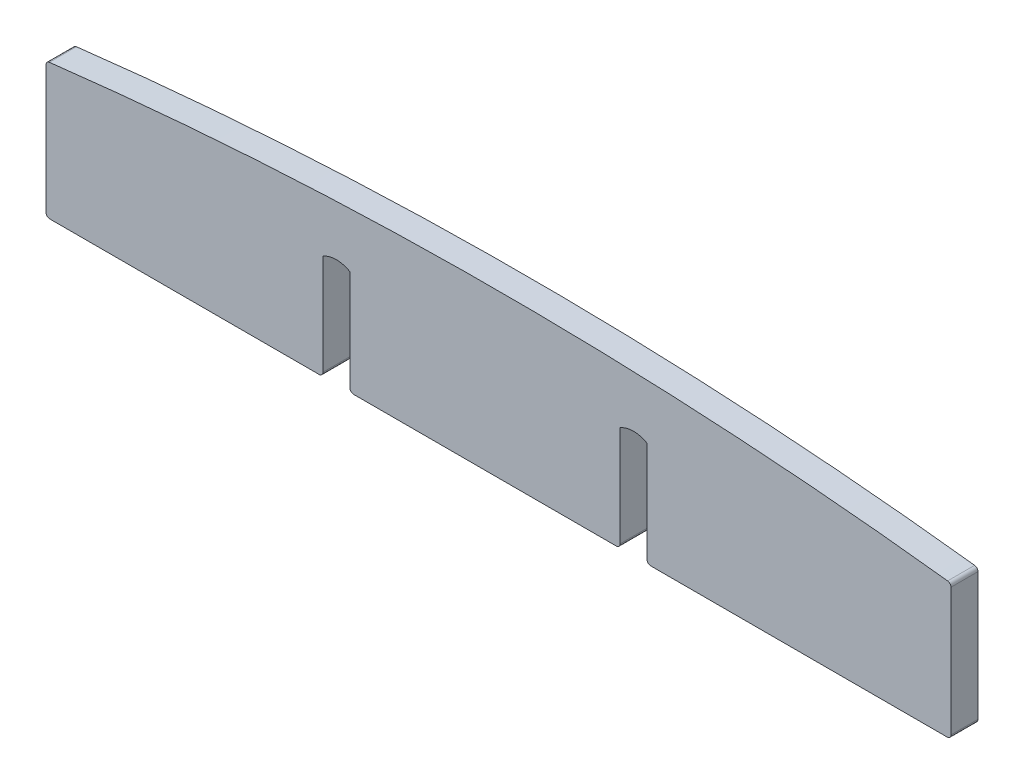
ISO-10303-21;
HEADER;
FILE_DESCRIPTION(('STEP AP214'),'2;1');
FILE_NAME('part.step','',(''),(''),'','','');
FILE_SCHEMA(('AUTOMOTIVE_DESIGN { 1 0 10303 214 1 1 1 1 }'));
ENDSEC;
DATA;
#1=APPLICATION_CONTEXT('core data for automotive mechanical design processes');
#2=APPLICATION_PROTOCOL_DEFINITION('international standard','automotive_design',2000,#1);
#3=PRODUCT_CONTEXT('',#1,'mechanical');
#4=PRODUCT('Part','Part','',(#3));
#5=PRODUCT_RELATED_PRODUCT_CATEGORY('part','',(#4));
#6=PRODUCT_DEFINITION_FORMATION('','',#4);
#7=PRODUCT_DEFINITION_CONTEXT('part definition',#1,'design');
#8=PRODUCT_DEFINITION('design','',#6,#7);
#9=PRODUCT_DEFINITION_SHAPE('','',#8);
#10=(LENGTH_UNIT() NAMED_UNIT(*) SI_UNIT(.MILLI.,.METRE.));
#11=(NAMED_UNIT(*) PLANE_ANGLE_UNIT() SI_UNIT($,.RADIAN.));
#12=(NAMED_UNIT(*) SI_UNIT($,.STERADIAN.) SOLID_ANGLE_UNIT());
#13=UNCERTAINTY_MEASURE_WITH_UNIT(LENGTH_MEASURE(1.E-05),#10,'distance_accuracy_value','');
#14=(GEOMETRIC_REPRESENTATION_CONTEXT(3) GLOBAL_UNCERTAINTY_ASSIGNED_CONTEXT((#13)) GLOBAL_UNIT_ASSIGNED_CONTEXT((#10,
#11,#12)) REPRESENTATION_CONTEXT('',''));
#15=CARTESIAN_POINT('',(0.,0.,0.));
#16=DIRECTION('',(0.,0.,1.));
#17=DIRECTION('',(1.,0.,0.));
#18=AXIS2_PLACEMENT_3D('',#15,#16,#17);
#19=CARTESIAN_POINT('',(-11.,-1.73205080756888,2.));
#20=DIRECTION('',(0.,0.,-1.));
#21=DIRECTION('',(-1.,0.,0.));
#22=AXIS2_PLACEMENT_3D('',#19,#20,#21);
#23=CYLINDRICAL_SURFACE('',#22,2.);
#24=CARTESIAN_POINT('',(-11.,-1.73205080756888,0.));
#25=DIRECTION('',(0.,0.,-1.));
#26=DIRECTION('',(1.,0.,0.));
#27=AXIS2_PLACEMENT_3D('',#24,#25,#26);
#28=CIRCLE('',#27,2.);
#29=CARTESIAN_POINT('',(-12.,0.,0.));
#30=VERTEX_POINT('',#29);
#31=CARTESIAN_POINT('',(-10.,0.,0.));
#32=VERTEX_POINT('',#31);
#33=EDGE_CURVE('E200',#30,#32,#28,.T.);
#34=ORIENTED_EDGE('',*,*,#33,.T.);
#35=DIRECTION('',(0.,0.,-1.));
#36=VECTOR('',#35,1.);
#37=CARTESIAN_POINT('',(-10.,0.,2.));
#38=LINE('',#37,#36);
#39=CARTESIAN_POINT('',(-10.,0.,2.));
#40=VERTEX_POINT('',#39);
#41=EDGE_CURVE('E11',#40,#32,#38,.T.);
#42=ORIENTED_EDGE('',*,*,#41,.F.);
#43=CARTESIAN_POINT('',(-11.,-1.73205080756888,2.));
#44=DIRECTION('',(0.,0.,-1.));
#45=DIRECTION('',(1.,0.,0.));
#46=AXIS2_PLACEMENT_3D('',#43,#44,#45);
#47=CIRCLE('',#46,2.);
#48=CARTESIAN_POINT('',(-12.,0.,2.));
#49=VERTEX_POINT('',#48);
#50=EDGE_CURVE('E238',#49,#40,#47,.T.);
#51=ORIENTED_EDGE('',*,*,#50,.F.);
#52=DIRECTION('',(0.,0.,-1.));
#53=VECTOR('',#52,1.);
#54=CARTESIAN_POINT('',(-12.,0.,2.));
#55=LINE('',#54,#53);
#56=EDGE_CURVE('E196',#49,#30,#55,.T.);
#57=ORIENTED_EDGE('',*,*,#56,.T.);
#58=EDGE_LOOP('',(#34,#42,#51,#57));
#59=FACE_BOUND('',#58,.T.);
#60=ADVANCED_FACE('F32',(#59),#23,.F.);
#61=CARTESIAN_POINT('',(-10.,-7.44989802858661,2.));
#62=DIRECTION('',(1.,0.,0.));
#63=DIRECTION('',(0.,0.,-1.));
#64=AXIS2_PLACEMENT_3D('',#61,#62,#63);
#65=PLANE('',#64);
#66=DIRECTION('',(0.,-1.,0.));
#67=VECTOR('',#66,1.);
#68=CARTESIAN_POINT('',(-10.,-7.44989802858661,0.));
#69=LINE('',#68,#67);
#70=CARTESIAN_POINT('',(-10.,-7.44989802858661,0.));
#71=VERTEX_POINT('',#70);
#72=EDGE_CURVE('E203',#32,#71,#69,.T.);
#73=ORIENTED_EDGE('',*,*,#72,.T.);
#74=DIRECTION('',(0.,0.,-1.));
#75=VECTOR('',#74,1.);
#76=CARTESIAN_POINT('',(-10.,-7.44989802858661,2.));
#77=LINE('',#76,#75);
#78=CARTESIAN_POINT('',(-10.,-7.44989802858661,2.));
#79=VERTEX_POINT('',#78);
#80=EDGE_CURVE('E40',#79,#71,#77,.T.);
#81=ORIENTED_EDGE('',*,*,#80,.F.);
#82=DIRECTION('',(0.,-1.,0.));
#83=VECTOR('',#82,1.);
#84=CARTESIAN_POINT('',(-10.,-7.44989802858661,2.));
#85=LINE('',#84,#83);
#86=EDGE_CURVE('E127',#40,#79,#85,.T.);
#87=ORIENTED_EDGE('',*,*,#86,.F.);
#88=ORIENTED_EDGE('',*,*,#41,.T.);
#89=EDGE_LOOP('',(#73,#81,#87,#88));
#90=FACE_BOUND('',#89,.T.);
#91=ADVANCED_FACE('F356',(#90),#65,.F.);
#92=CARTESIAN_POINT('',(-9.71784722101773,-7.44989802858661,2.));
#93=DIRECTION('',(0.,0.,-1.));
#94=DIRECTION('',(-1.,0.,0.));
#95=AXIS2_PLACEMENT_3D('',#92,#93,#94);
#96=CYLINDRICAL_SURFACE('',#95,0.28215277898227);
#97=CARTESIAN_POINT('',(-9.71784722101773,-7.44989802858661,0.));
#98=DIRECTION('',(0.,0.,1.));
#99=DIRECTION('',(1.,0.,0.));
#100=AXIS2_PLACEMENT_3D('',#97,#98,#99);
#101=CIRCLE('',#100,0.28215277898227);
#102=CARTESIAN_POINT('',(-9.71784722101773,-7.73205080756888,0.));
#103=VERTEX_POINT('',#102);
#104=EDGE_CURVE('E205',#71,#103,#101,.T.);
#105=ORIENTED_EDGE('',*,*,#104,.T.);
#106=DIRECTION('',(0.,0.,-1.));
#107=VECTOR('',#106,1.);
#108=CARTESIAN_POINT('',(-9.71784722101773,-7.73205080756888,2.));
#109=LINE('',#108,#107);
#110=CARTESIAN_POINT('',(-9.71784722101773,-7.73205080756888,2.));
#111=VERTEX_POINT('',#110);
#112=EDGE_CURVE('E281',#111,#103,#109,.T.);
#113=ORIENTED_EDGE('',*,*,#112,.F.);
#114=CARTESIAN_POINT('',(-9.71784722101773,-7.44989802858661,2.));
#115=DIRECTION('',(0.,0.,1.));
#116=DIRECTION('',(1.,0.,0.));
#117=AXIS2_PLACEMENT_3D('',#114,#115,#116);
#118=CIRCLE('',#117,0.28215277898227);
#119=EDGE_CURVE('E289',#79,#111,#118,.T.);
#120=ORIENTED_EDGE('',*,*,#119,.F.);
#121=ORIENTED_EDGE('',*,*,#80,.T.);
#122=EDGE_LOOP('',(#105,#113,#120,#121));
#123=FACE_BOUND('',#122,.T.);
#124=ADVANCED_FACE('F287',(#123),#96,.T.);
#125=CARTESIAN_POINT('',(-9.71784722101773,-7.73205080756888,2.));
#126=DIRECTION('',(0.,1.,0.));
#127=DIRECTION('',(0.,0.,1.));
#128=AXIS2_PLACEMENT_3D('',#125,#126,#127);
#129=PLANE('',#128);
#130=DIRECTION('',(1.,0.,0.));
#131=VECTOR('',#130,1.);
#132=CARTESIAN_POINT('',(-9.71784722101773,-7.73205080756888,0.));
#133=LINE('',#132,#131);
#134=CARTESIAN_POINT('',(9.71784722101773,-7.73205080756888,0.));
#135=VERTEX_POINT('',#134);
#136=EDGE_CURVE('E207',#103,#135,#133,.T.);
#137=ORIENTED_EDGE('',*,*,#136,.T.);
#138=DIRECTION('',(0.,0.,-1.));
#139=VECTOR('',#138,1.);
#140=CARTESIAN_POINT('',(9.71784722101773,-7.73205080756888,2.));
#141=LINE('',#140,#139);
#142=CARTESIAN_POINT('',(9.71784722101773,-7.73205080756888,2.));
#143=VERTEX_POINT('',#142);
#144=EDGE_CURVE('E278',#143,#135,#141,.T.);
#145=ORIENTED_EDGE('',*,*,#144,.F.);
#146=DIRECTION('',(1.,0.,0.));
#147=VECTOR('',#146,1.);
#148=CARTESIAN_POINT('',(-9.71784722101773,-7.73205080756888,2.));
#149=LINE('',#148,#147);
#150=EDGE_CURVE('E307',#111,#143,#149,.T.);
#151=ORIENTED_EDGE('',*,*,#150,.F.);
#152=ORIENTED_EDGE('',*,*,#112,.T.);
#153=EDGE_LOOP('',(#137,#145,#151,#152));
#154=FACE_BOUND('',#153,.T.);
#155=ADVANCED_FACE('F298',(#154),#129,.F.);
#156=CARTESIAN_POINT('',(9.71784722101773,-7.44989802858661,2.));
#157=DIRECTION('',(0.,0.,-1.));
#158=DIRECTION('',(-1.,0.,0.));
#159=AXIS2_PLACEMENT_3D('',#156,#157,#158);
#160=CYLINDRICAL_SURFACE('',#159,0.28215277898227);
#161=CARTESIAN_POINT('',(9.71784722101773,-7.44989802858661,0.));
#162=DIRECTION('',(0.,0.,1.));
#163=DIRECTION('',(-1.,0.,0.));
#164=AXIS2_PLACEMENT_3D('',#161,#162,#163);
#165=CIRCLE('',#164,0.28215277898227);
#166=CARTESIAN_POINT('',(10.,-7.44989802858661,0.));
#167=VERTEX_POINT('',#166);
#168=EDGE_CURVE('E209',#135,#167,#165,.T.);
#169=ORIENTED_EDGE('',*,*,#168,.T.);
#170=DIRECTION('',(0.,0.,-1.));
#171=VECTOR('',#170,1.);
#172=CARTESIAN_POINT('',(10.,-7.44989802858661,2.));
#173=LINE('',#172,#171);
#174=CARTESIAN_POINT('',(10.,-7.44989802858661,2.));
#175=VERTEX_POINT('',#174);
#176=EDGE_CURVE('E275',#175,#167,#173,.T.);
#177=ORIENTED_EDGE('',*,*,#176,.F.);
#178=CARTESIAN_POINT('',(9.71784722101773,-7.44989802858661,2.));
#179=DIRECTION('',(0.,0.,1.));
#180=DIRECTION('',(-1.,0.,0.));
#181=AXIS2_PLACEMENT_3D('',#178,#179,#180);
#182=CIRCLE('',#181,0.28215277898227);
#183=EDGE_CURVE('E304',#143,#175,#182,.T.);
#184=ORIENTED_EDGE('',*,*,#183,.F.);
#185=ORIENTED_EDGE('',*,*,#144,.T.);
#186=EDGE_LOOP('',(#169,#177,#184,#185));
#187=FACE_BOUND('',#186,.T.);
#188=ADVANCED_FACE('F302',(#187),#160,.T.);
#189=CARTESIAN_POINT('',(10.,-7.44989802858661,2.));
#190=DIRECTION('',(-1.,0.,0.));
#191=DIRECTION('',(0.,0.,1.));
#192=AXIS2_PLACEMENT_3D('',#189,#190,#191);
#193=PLANE('',#192);
#194=DIRECTION('',(0.,1.,0.));
#195=VECTOR('',#194,1.);
#196=CARTESIAN_POINT('',(10.,-7.44989802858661,0.));
#197=LINE('',#196,#195);
#198=CARTESIAN_POINT('',(10.,0.,0.));
#199=VERTEX_POINT('',#198);
#200=EDGE_CURVE('E211',#167,#199,#197,.T.);
#201=ORIENTED_EDGE('',*,*,#200,.T.);
#202=DIRECTION('',(0.,0.,-1.));
#203=VECTOR('',#202,1.);
#204=CARTESIAN_POINT('',(10.,0.,2.));
#205=LINE('',#204,#203);
#206=CARTESIAN_POINT('',(10.,0.,2.));
#207=VERTEX_POINT('',#206);
#208=EDGE_CURVE('E272',#207,#199,#205,.T.);
#209=ORIENTED_EDGE('',*,*,#208,.F.);
#210=DIRECTION('',(0.,1.,0.));
#211=VECTOR('',#210,1.);
#212=CARTESIAN_POINT('',(10.,-7.44989802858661,2.));
#213=LINE('',#212,#211);
#214=EDGE_CURVE('E306',#175,#207,#213,.T.);
#215=ORIENTED_EDGE('',*,*,#214,.F.);
#216=ORIENTED_EDGE('',*,*,#176,.T.);
#217=EDGE_LOOP('',(#201,#209,#215,#216));
#218=FACE_BOUND('',#217,.T.);
#219=ADVANCED_FACE('F369',(#218),#193,.F.);
#220=CARTESIAN_POINT('',(11.,-1.73205080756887,2.));
#221=DIRECTION('',(0.,0.,-1.));
#222=DIRECTION('',(-1.,0.,0.));
#223=AXIS2_PLACEMENT_3D('',#220,#221,#222);
#224=CYLINDRICAL_SURFACE('',#223,2.);
#225=CARTESIAN_POINT('',(11.,-1.73205080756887,0.));
#226=DIRECTION('',(0.,0.,-1.));
#227=DIRECTION('',(1.,0.,0.));
#228=AXIS2_PLACEMENT_3D('',#225,#226,#227);
#229=CIRCLE('',#228,2.);
#230=CARTESIAN_POINT('',(12.,0.,0.));
#231=VERTEX_POINT('',#230);
#232=EDGE_CURVE('E213',#199,#231,#229,.T.);
#233=ORIENTED_EDGE('',*,*,#232,.T.);
#234=DIRECTION('',(0.,0.,-1.));
#235=VECTOR('',#234,1.);
#236=CARTESIAN_POINT('',(12.,0.,2.));
#237=LINE('',#236,#235);
#238=CARTESIAN_POINT('',(12.,0.,2.));
#239=VERTEX_POINT('',#238);
#240=EDGE_CURVE('E269',#239,#231,#237,.T.);
#241=ORIENTED_EDGE('',*,*,#240,.F.);
#242=CARTESIAN_POINT('',(11.,-1.73205080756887,2.));
#243=DIRECTION('',(0.,0.,-1.));
#244=DIRECTION('',(1.,0.,0.));
#245=AXIS2_PLACEMENT_3D('',#242,#243,#244);
#246=CIRCLE('',#245,2.);
#247=EDGE_CURVE('E309',#207,#239,#246,.T.);
#248=ORIENTED_EDGE('',*,*,#247,.F.);
#249=ORIENTED_EDGE('',*,*,#208,.T.);
#250=EDGE_LOOP('',(#233,#241,#248,#249));
#251=FACE_BOUND('',#250,.T.);
#252=ADVANCED_FACE('F372',(#251),#224,.F.);
#253=CARTESIAN_POINT('',(12.,-7.44989802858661,2.));
#254=DIRECTION('',(1.,0.,0.));
#255=DIRECTION('',(0.,0.,-1.));
#256=AXIS2_PLACEMENT_3D('',#253,#254,#255);
#257=PLANE('',#256);
#258=DIRECTION('',(0.,-1.,0.));
#259=VECTOR('',#258,1.);
#260=CARTESIAN_POINT('',(12.,-7.44989802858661,0.));
#261=LINE('',#260,#259);
#262=CARTESIAN_POINT('',(12.,-7.44989802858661,0.));
#263=VERTEX_POINT('',#262);
#264=EDGE_CURVE('E215',#231,#263,#261,.T.);
#265=ORIENTED_EDGE('',*,*,#264,.T.);
#266=DIRECTION('',(0.,0.,-1.));
#267=VECTOR('',#266,1.);
#268=CARTESIAN_POINT('',(12.,-7.44989802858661,2.));
#269=LINE('',#268,#267);
#270=CARTESIAN_POINT('',(12.,-7.44989802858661,2.));
#271=VERTEX_POINT('',#270);
#272=EDGE_CURVE('E266',#271,#263,#269,.T.);
#273=ORIENTED_EDGE('',*,*,#272,.F.);
#274=DIRECTION('',(0.,-1.,0.));
#275=VECTOR('',#274,1.);
#276=CARTESIAN_POINT('',(12.,-7.44989802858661,2.));
#277=LINE('',#276,#275);
#278=EDGE_CURVE('E315',#239,#271,#277,.T.);
#279=ORIENTED_EDGE('',*,*,#278,.F.);
#280=ORIENTED_EDGE('',*,*,#240,.T.);
#281=EDGE_LOOP('',(#265,#273,#279,#280));
#282=FACE_BOUND('',#281,.T.);
#283=ADVANCED_FACE('F376',(#282),#257,.F.);
#284=CARTESIAN_POINT('',(12.2821527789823,-7.44989802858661,2.));
#285=DIRECTION('',(0.,0.,-1.));
#286=DIRECTION('',(-1.,0.,0.));
#287=AXIS2_PLACEMENT_3D('',#284,#285,#286);
#288=CYLINDRICAL_SURFACE('',#287,0.282152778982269);
#289=CARTESIAN_POINT('',(12.2821527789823,-7.44989802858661,0.));
#290=DIRECTION('',(0.,0.,1.));
#291=DIRECTION('',(1.,0.,0.));
#292=AXIS2_PLACEMENT_3D('',#289,#290,#291);
#293=CIRCLE('',#292,0.282152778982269);
#294=CARTESIAN_POINT('',(12.2821527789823,-7.73205080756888,0.));
#295=VERTEX_POINT('',#294);
#296=EDGE_CURVE('E217',#263,#295,#293,.T.);
#297=ORIENTED_EDGE('',*,*,#296,.T.);
#298=DIRECTION('',(0.,0.,-1.));
#299=VECTOR('',#298,1.);
#300=CARTESIAN_POINT('',(12.2821527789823,-7.73205080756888,2.));
#301=LINE('',#300,#299);
#302=CARTESIAN_POINT('',(12.2821527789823,-7.73205080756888,2.));
#303=VERTEX_POINT('',#302);
#304=EDGE_CURVE('E263',#303,#295,#301,.T.);
#305=ORIENTED_EDGE('',*,*,#304,.F.);
#306=CARTESIAN_POINT('',(12.2821527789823,-7.44989802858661,2.));
#307=DIRECTION('',(0.,0.,1.));
#308=DIRECTION('',(1.,0.,0.));
#309=AXIS2_PLACEMENT_3D('',#306,#307,#308);
#310=CIRCLE('',#309,0.282152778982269);
#311=EDGE_CURVE('E317',#271,#303,#310,.T.);
#312=ORIENTED_EDGE('',*,*,#311,.F.);
#313=ORIENTED_EDGE('',*,*,#272,.T.);
#314=EDGE_LOOP('',(#297,#305,#312,#313));
#315=FACE_BOUND('',#314,.T.);
#316=ADVANCED_FACE('F380',(#315),#288,.T.);
#317=CARTESIAN_POINT('',(12.2821527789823,-7.73205080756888,2.));
#318=DIRECTION('',(0.,1.,0.));
#319=DIRECTION('',(0.,0.,1.));
#320=AXIS2_PLACEMENT_3D('',#317,#318,#319);
#321=PLANE('',#320);
#322=DIRECTION('',(1.,0.,0.));
#323=VECTOR('',#322,1.);
#324=CARTESIAN_POINT('',(12.2821527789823,-7.73205080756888,0.));
#325=LINE('',#324,#323);
#326=CARTESIAN_POINT('',(34.2178472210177,-7.73205080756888,0.));
#327=VERTEX_POINT('',#326);
#328=EDGE_CURVE('E219',#295,#327,#325,.T.);
#329=ORIENTED_EDGE('',*,*,#328,.T.);
#330=DIRECTION('',(0.,0.,-1.));
#331=VECTOR('',#330,1.);
#332=CARTESIAN_POINT('',(34.2178472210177,-7.73205080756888,2.));
#333=LINE('',#332,#331);
#334=CARTESIAN_POINT('',(34.2178472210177,-7.73205080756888,2.));
#335=VERTEX_POINT('',#334);
#336=EDGE_CURVE('E260',#335,#327,#333,.T.);
#337=ORIENTED_EDGE('',*,*,#336,.F.);
#338=DIRECTION('',(1.,0.,0.));
#339=VECTOR('',#338,1.);
#340=CARTESIAN_POINT('',(12.2821527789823,-7.73205080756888,2.));
#341=LINE('',#340,#339);
#342=EDGE_CURVE('E319',#303,#335,#341,.T.);
#343=ORIENTED_EDGE('',*,*,#342,.F.);
#344=ORIENTED_EDGE('',*,*,#304,.T.);
#345=EDGE_LOOP('',(#329,#337,#343,#344));
#346=FACE_BOUND('',#345,.T.);
#347=ADVANCED_FACE('F384',(#346),#321,.F.);
#348=CARTESIAN_POINT('',(34.2178472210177,-7.44989802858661,2.));
#349=DIRECTION('',(0.,0.,-1.));
#350=DIRECTION('',(-1.,0.,0.));
#351=AXIS2_PLACEMENT_3D('',#348,#349,#350);
#352=CYLINDRICAL_SURFACE('',#351,0.282152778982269);
#353=CARTESIAN_POINT('',(34.2178472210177,-7.44989802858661,0.));
#354=DIRECTION('',(0.,0.,1.));
#355=DIRECTION('',(1.,0.,0.));
#356=AXIS2_PLACEMENT_3D('',#353,#354,#355);
#357=CIRCLE('',#356,0.282152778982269);
#358=CARTESIAN_POINT('',(34.5,-7.44989802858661,0.));
#359=VERTEX_POINT('',#358);
#360=EDGE_CURVE('E221',#327,#359,#357,.T.);
#361=ORIENTED_EDGE('',*,*,#360,.T.);
#362=DIRECTION('',(0.,0.,-1.));
#363=VECTOR('',#362,1.);
#364=CARTESIAN_POINT('',(34.5,-7.44989802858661,2.));
#365=LINE('',#364,#363);
#366=CARTESIAN_POINT('',(34.5,-7.44989802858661,2.));
#367=VERTEX_POINT('',#366);
#368=EDGE_CURVE('E257',#367,#359,#365,.T.);
#369=ORIENTED_EDGE('',*,*,#368,.F.);
#370=CARTESIAN_POINT('',(34.2178472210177,-7.44989802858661,2.));
#371=DIRECTION('',(0.,0.,1.));
#372=DIRECTION('',(1.,0.,0.));
#373=AXIS2_PLACEMENT_3D('',#370,#371,#372);
#374=CIRCLE('',#373,0.282152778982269);
#375=EDGE_CURVE('E321',#335,#367,#374,.T.);
#376=ORIENTED_EDGE('',*,*,#375,.F.);
#377=ORIENTED_EDGE('',*,*,#336,.T.);
#378=EDGE_LOOP('',(#361,#369,#376,#377));
#379=FACE_BOUND('',#378,.T.);
#380=ADVANCED_FACE('F388',(#379),#352,.T.);
#381=CARTESIAN_POINT('',(34.5,2.01747607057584,2.));
#382=DIRECTION('',(-1.,0.,0.));
#383=DIRECTION('',(0.,-1.,0.));
#384=AXIS2_PLACEMENT_3D('',#381,#382,#383);
#385=PLANE('',#384);
#386=DIRECTION('',(0.,1.,0.));
#387=VECTOR('',#386,1.);
#388=CARTESIAN_POINT('',(34.5,2.01747607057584,0.));
#389=LINE('',#388,#387);
#390=CARTESIAN_POINT('',(34.5,2.01747607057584,0.));
#391=VERTEX_POINT('',#390);
#392=EDGE_CURVE('E223',#359,#391,#389,.T.);
#393=ORIENTED_EDGE('',*,*,#392,.T.);
#394=DIRECTION('',(0.,0.,-1.));
#395=VECTOR('',#394,1.);
#396=CARTESIAN_POINT('',(34.5,2.01747607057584,2.));
#397=LINE('',#396,#395);
#398=CARTESIAN_POINT('',(34.5,2.01747607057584,2.));
#399=VERTEX_POINT('',#398);
#400=EDGE_CURVE('E254',#399,#391,#397,.T.);
#401=ORIENTED_EDGE('',*,*,#400,.F.);
#402=DIRECTION('',(0.,1.,0.));
#403=VECTOR('',#402,1.);
#404=CARTESIAN_POINT('',(34.5,2.01747607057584,2.));
#405=LINE('',#404,#403);
#406=EDGE_CURVE('E323',#367,#399,#405,.T.);
#407=ORIENTED_EDGE('',*,*,#406,.F.);
#408=ORIENTED_EDGE('',*,*,#368,.T.);
#409=EDGE_LOOP('',(#393,#401,#407,#408));
#410=FACE_BOUND('',#409,.T.);
#411=ADVANCED_FACE('F392',(#410),#385,.F.);
#412=CARTESIAN_POINT('',(34.2178472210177,2.01747607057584,2.));
#413=DIRECTION('',(0.,0.,-1.));
#414=DIRECTION('',(-1.,0.,0.));
#415=AXIS2_PLACEMENT_3D('',#412,#413,#414);
#416=CYLINDRICAL_SURFACE('',#415,0.282152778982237);
#417=CARTESIAN_POINT('',(34.2178472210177,2.01747607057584,0.));
#418=DIRECTION('',(0.,0.,1.));
#419=DIRECTION('',(-1.,0.,0.));
#420=AXIS2_PLACEMENT_3D('',#417,#418,#419);
#421=CIRCLE('',#420,0.282152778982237);
#422=CARTESIAN_POINT('',(34.251168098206,2.29765442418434,0.));
#423=VERTEX_POINT('',#422);
#424=EDGE_CURVE('E225',#391,#423,#421,.T.);
#425=ORIENTED_EDGE('',*,*,#424,.T.);
#426=DIRECTION('',(0.,0.,-1.));
#427=VECTOR('',#426,1.);
#428=CARTESIAN_POINT('',(34.251168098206,2.29765442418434,2.));
#429=LINE('',#428,#427);
#430=CARTESIAN_POINT('',(34.251168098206,2.29765442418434,2.));
#431=VERTEX_POINT('',#430);
#432=EDGE_CURVE('E251',#431,#423,#429,.T.);
#433=ORIENTED_EDGE('',*,*,#432,.F.);
#434=CARTESIAN_POINT('',(34.2178472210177,2.01747607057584,2.));
#435=DIRECTION('',(0.,0.,1.));
#436=DIRECTION('',(-1.,0.,0.));
#437=AXIS2_PLACEMENT_3D('',#434,#435,#436);
#438=CIRCLE('',#437,0.282152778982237);
#439=EDGE_CURVE('E325',#399,#431,#438,.T.);
#440=ORIENTED_EDGE('',*,*,#439,.F.);
#441=ORIENTED_EDGE('',*,*,#400,.T.);
#442=EDGE_LOOP('',(#425,#433,#440,#441));
#443=FACE_BOUND('',#442,.T.);
#444=ADVANCED_FACE('F396',(#443),#416,.T.);
#445=CARTESIAN_POINT('',(1.,-277.294550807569,2.));
#446=DIRECTION('',(0.,0.,-1.));
#447=DIRECTION('',(-1.,0.,0.));
#448=AXIS2_PLACEMENT_3D('',#445,#446,#447);
#449=CYLINDRICAL_SURFACE('',#448,281.5625);
#450=CARTESIAN_POINT('',(1.,-277.294550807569,0.));
#451=DIRECTION('',(0.,0.,1.));
#452=DIRECTION('',(-1.,0.,0.));
#453=AXIS2_PLACEMENT_3D('',#450,#451,#452);
#454=CIRCLE('',#453,281.5625);
#455=CARTESIAN_POINT('',(-32.251168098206,2.2976544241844,0.));
#456=VERTEX_POINT('',#455);
#457=EDGE_CURVE('E227',#423,#456,#454,.T.);
#458=ORIENTED_EDGE('',*,*,#457,.T.);
#459=DIRECTION('',(0.,0.,-1.));
#460=VECTOR('',#459,1.);
#461=CARTESIAN_POINT('',(-32.251168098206,2.2976544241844,2.));
#462=LINE('',#461,#460);
#463=CARTESIAN_POINT('',(-32.251168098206,2.2976544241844,2.));
#464=VERTEX_POINT('',#463);
#465=EDGE_CURVE('E248',#464,#456,#462,.T.);
#466=ORIENTED_EDGE('',*,*,#465,.F.);
#467=CARTESIAN_POINT('',(1.,-277.294550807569,2.));
#468=DIRECTION('',(0.,0.,1.));
#469=DIRECTION('',(-1.,0.,0.));
#470=AXIS2_PLACEMENT_3D('',#467,#468,#469);
#471=CIRCLE('',#470,281.5625);
#472=EDGE_CURVE('E327',#431,#464,#471,.T.);
#473=ORIENTED_EDGE('',*,*,#472,.F.);
#474=ORIENTED_EDGE('',*,*,#432,.T.);
#475=EDGE_LOOP('',(#458,#466,#473,#474));
#476=FACE_BOUND('',#475,.T.);
#477=ADVANCED_FACE('F400',(#476),#449,.T.);
#478=CARTESIAN_POINT('',(-32.2178472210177,2.01747607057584,2.));
#479=DIRECTION('',(0.,0.,-1.));
#480=DIRECTION('',(-1.,0.,0.));
#481=AXIS2_PLACEMENT_3D('',#478,#479,#480);
#482=CYLINDRICAL_SURFACE('',#481,0.282152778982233);
#483=CARTESIAN_POINT('',(-32.2178472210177,2.01747607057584,0.));
#484=DIRECTION('',(0.,0.,1.));
#485=DIRECTION('',(1.,0.,0.));
#486=AXIS2_PLACEMENT_3D('',#483,#484,#485);
#487=CIRCLE('',#486,0.282152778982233);
#488=CARTESIAN_POINT('',(-32.5,2.01747607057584,0.));
#489=VERTEX_POINT('',#488);
#490=EDGE_CURVE('E229',#456,#489,#487,.T.);
#491=ORIENTED_EDGE('',*,*,#490,.T.);
#492=DIRECTION('',(0.,0.,-1.));
#493=VECTOR('',#492,1.);
#494=CARTESIAN_POINT('',(-32.5,2.01747607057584,2.));
#495=LINE('',#494,#493);
#496=CARTESIAN_POINT('',(-32.5,2.01747607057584,2.));
#497=VERTEX_POINT('',#496);
#498=EDGE_CURVE('E245',#497,#489,#495,.T.);
#499=ORIENTED_EDGE('',*,*,#498,.F.);
#500=CARTESIAN_POINT('',(-32.2178472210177,2.01747607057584,2.));
#501=DIRECTION('',(0.,0.,1.));
#502=DIRECTION('',(1.,0.,0.));
#503=AXIS2_PLACEMENT_3D('',#500,#501,#502);
#504=CIRCLE('',#503,0.282152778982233);
#505=EDGE_CURVE('E329',#464,#497,#504,.T.);
#506=ORIENTED_EDGE('',*,*,#505,.F.);
#507=ORIENTED_EDGE('',*,*,#465,.T.);
#508=EDGE_LOOP('',(#491,#499,#506,#507));
#509=FACE_BOUND('',#508,.T.);
#510=ADVANCED_FACE('F404',(#509),#482,.T.);
#511=CARTESIAN_POINT('',(-32.5,2.01747607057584,2.));
#512=DIRECTION('',(1.,0.,0.));
#513=DIRECTION('',(0.,0.,-1.));
#514=AXIS2_PLACEMENT_3D('',#511,#512,#513);
#515=PLANE('',#514);
#516=DIRECTION('',(0.,-1.,0.));
#517=VECTOR('',#516,1.);
#518=CARTESIAN_POINT('',(-32.5,2.01747607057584,0.));
#519=LINE('',#518,#517);
#520=CARTESIAN_POINT('',(-32.5,-7.44989802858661,0.));
#521=VERTEX_POINT('',#520);
#522=EDGE_CURVE('E231',#489,#521,#519,.T.);
#523=ORIENTED_EDGE('',*,*,#522,.T.);
#524=DIRECTION('',(0.,0.,-1.));
#525=VECTOR('',#524,1.);
#526=CARTESIAN_POINT('',(-32.5,-7.44989802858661,2.));
#527=LINE('',#526,#525);
#528=CARTESIAN_POINT('',(-32.5,-7.44989802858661,2.));
#529=VERTEX_POINT('',#528);
#530=EDGE_CURVE('E242',#529,#521,#527,.T.);
#531=ORIENTED_EDGE('',*,*,#530,.F.);
#532=DIRECTION('',(0.,-1.,0.));
#533=VECTOR('',#532,1.);
#534=CARTESIAN_POINT('',(-32.5,2.01747607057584,2.));
#535=LINE('',#534,#533);
#536=EDGE_CURVE('E331',#497,#529,#535,.T.);
#537=ORIENTED_EDGE('',*,*,#536,.F.);
#538=ORIENTED_EDGE('',*,*,#498,.T.);
#539=EDGE_LOOP('',(#523,#531,#537,#538));
#540=FACE_BOUND('',#539,.T.);
#541=ADVANCED_FACE('F337',(#540),#515,.F.);
#542=CARTESIAN_POINT('',(-32.2178472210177,-7.44989802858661,2.));
#543=DIRECTION('',(0.,0.,-1.));
#544=DIRECTION('',(-1.,0.,0.));
#545=AXIS2_PLACEMENT_3D('',#542,#543,#544);
#546=CYLINDRICAL_SURFACE('',#545,0.282152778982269);
#547=CARTESIAN_POINT('',(-32.2178472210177,-7.44989802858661,0.));
#548=DIRECTION('',(0.,0.,1.));
#549=DIRECTION('',(1.,0.,0.));
#550=AXIS2_PLACEMENT_3D('',#547,#548,#549);
#551=CIRCLE('',#550,0.282152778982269);
#552=CARTESIAN_POINT('',(-32.2178472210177,-7.73205080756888,0.));
#553=VERTEX_POINT('',#552);
#554=EDGE_CURVE('E233',#521,#553,#551,.T.);
#555=ORIENTED_EDGE('',*,*,#554,.T.);
#556=DIRECTION('',(0.,0.,-1.));
#557=VECTOR('',#556,1.);
#558=CARTESIAN_POINT('',(-32.2178472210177,-7.73205080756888,2.));
#559=LINE('',#558,#557);
#560=CARTESIAN_POINT('',(-32.2178472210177,-7.73205080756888,2.));
#561=VERTEX_POINT('',#560);
#562=EDGE_CURVE('E191',#561,#553,#559,.T.);
#563=ORIENTED_EDGE('',*,*,#562,.F.);
#564=CARTESIAN_POINT('',(-32.2178472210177,-7.44989802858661,2.));
#565=DIRECTION('',(0.,0.,1.));
#566=DIRECTION('',(1.,0.,0.));
#567=AXIS2_PLACEMENT_3D('',#564,#565,#566);
#568=CIRCLE('',#567,0.282152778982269);
#569=EDGE_CURVE('E182',#529,#561,#568,.T.);
#570=ORIENTED_EDGE('',*,*,#569,.F.);
#571=ORIENTED_EDGE('',*,*,#530,.T.);
#572=EDGE_LOOP('',(#555,#563,#570,#571));
#573=FACE_BOUND('',#572,.T.);
#574=ADVANCED_FACE('F341',(#573),#546,.T.);
#575=CARTESIAN_POINT('',(-32.2178472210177,-7.73205080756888,2.));
#576=DIRECTION('',(0.,1.,0.));
#577=DIRECTION('',(-1.,0.,0.));
#578=AXIS2_PLACEMENT_3D('',#575,#576,#577);
#579=PLANE('',#578);
#580=DIRECTION('',(1.,0.,0.));
#581=VECTOR('',#580,1.);
#582=CARTESIAN_POINT('',(-32.2178472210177,-7.73205080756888,0.));
#583=LINE('',#582,#581);
#584=CARTESIAN_POINT('',(-12.2821527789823,-7.73205080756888,0.));
#585=VERTEX_POINT('',#584);
#586=EDGE_CURVE('E190',#553,#585,#583,.T.);
#587=ORIENTED_EDGE('',*,*,#586,.T.);
#588=DIRECTION('',(0.,0.,-1.));
#589=VECTOR('',#588,1.);
#590=CARTESIAN_POINT('',(-12.2821527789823,-7.73205080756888,2.));
#591=LINE('',#590,#589);
#592=CARTESIAN_POINT('',(-12.2821527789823,-7.73205080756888,2.));
#593=VERTEX_POINT('',#592);
#594=EDGE_CURVE('E187',#593,#585,#591,.T.);
#595=ORIENTED_EDGE('',*,*,#594,.F.);
#596=DIRECTION('',(1.,0.,0.));
#597=VECTOR('',#596,1.);
#598=CARTESIAN_POINT('',(-32.2178472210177,-7.73205080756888,2.));
#599=LINE('',#598,#597);
#600=EDGE_CURVE('E176',#561,#593,#599,.T.);
#601=ORIENTED_EDGE('',*,*,#600,.F.);
#602=ORIENTED_EDGE('',*,*,#562,.T.);
#603=EDGE_LOOP('',(#587,#595,#601,#602));
#604=FACE_BOUND('',#603,.T.);
#605=ADVANCED_FACE('F188',(#604),#579,.F.);
#606=CARTESIAN_POINT('',(-12.2821527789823,-7.44989802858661,2.));
#607=DIRECTION('',(0.,0.,-1.));
#608=DIRECTION('',(-1.,0.,0.));
#609=AXIS2_PLACEMENT_3D('',#606,#607,#608);
#610=CYLINDRICAL_SURFACE('',#609,0.282152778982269);
#611=CARTESIAN_POINT('',(-12.2821527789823,-7.44989802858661,0.));
#612=DIRECTION('',(0.,0.,1.));
#613=DIRECTION('',(-1.,0.,0.));
#614=AXIS2_PLACEMENT_3D('',#611,#612,#613);
#615=CIRCLE('',#614,0.282152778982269);
#616=CARTESIAN_POINT('',(-12.,-7.44989802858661,0.));
#617=VERTEX_POINT('',#616);
#618=EDGE_CURVE('E113',#585,#617,#615,.T.);
#619=ORIENTED_EDGE('',*,*,#618,.T.);
#620=DIRECTION('',(0.,0.,-1.));
#621=VECTOR('',#620,1.);
#622=CARTESIAN_POINT('',(-12.,-7.44989802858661,2.));
#623=LINE('',#622,#621);
#624=CARTESIAN_POINT('',(-12.,-7.44989802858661,2.));
#625=VERTEX_POINT('',#624);
#626=EDGE_CURVE('E192',#625,#617,#623,.T.);
#627=ORIENTED_EDGE('',*,*,#626,.F.);
#628=CARTESIAN_POINT('',(-12.2821527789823,-7.44989802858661,2.));
#629=DIRECTION('',(0.,0.,1.));
#630=DIRECTION('',(-1.,0.,0.));
#631=AXIS2_PLACEMENT_3D('',#628,#629,#630);
#632=CIRCLE('',#631,0.282152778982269);
#633=EDGE_CURVE('E180',#593,#625,#632,.T.);
#634=ORIENTED_EDGE('',*,*,#633,.F.);
#635=ORIENTED_EDGE('',*,*,#594,.T.);
#636=EDGE_LOOP('',(#619,#627,#634,#635));
#637=FACE_BOUND('',#636,.T.);
#638=ADVANCED_FACE('F194',(#637),#610,.T.);
#639=CARTESIAN_POINT('',(-12.,-7.44989802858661,2.));
#640=DIRECTION('',(-1.,0.,0.));
#641=DIRECTION('',(0.,0.,1.));
#642=AXIS2_PLACEMENT_3D('',#639,#640,#641);
#643=PLANE('',#642);
#644=DIRECTION('',(0.,1.,0.));
#645=VECTOR('',#644,1.);
#646=CARTESIAN_POINT('',(-12.,-7.44989802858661,0.));
#647=LINE('',#646,#645);
#648=EDGE_CURVE('E119',#617,#30,#647,.T.);
#649=ORIENTED_EDGE('',*,*,#648,.T.);
#650=ORIENTED_EDGE('',*,*,#56,.F.);
#651=DIRECTION('',(0.,1.,0.));
#652=VECTOR('',#651,1.);
#653=CARTESIAN_POINT('',(-12.,-7.44989802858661,2.));
#654=LINE('',#653,#652);
#655=EDGE_CURVE('E48',#625,#49,#654,.T.);
#656=ORIENTED_EDGE('',*,*,#655,.F.);
#657=ORIENTED_EDGE('',*,*,#626,.T.);
#658=EDGE_LOOP('',(#649,#650,#656,#657));
#659=FACE_BOUND('',#658,.T.);
#660=ADVANCED_FACE('F345',(#659),#643,.F.);
#661=CARTESIAN_POINT('',(-11.,-1.73205080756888,2.));
#662=DIRECTION('',(0.,0.,1.));
#663=DIRECTION('',(1.,0.,0.));
#664=AXIS2_PLACEMENT_3D('',#661,#662,#663);
#665=PLANE('',#664);
#666=ORIENTED_EDGE('',*,*,#50,.T.);
#667=ORIENTED_EDGE('',*,*,#86,.T.);
#668=ORIENTED_EDGE('',*,*,#119,.T.);
#669=ORIENTED_EDGE('',*,*,#150,.T.);
#670=ORIENTED_EDGE('',*,*,#183,.T.);
#671=ORIENTED_EDGE('',*,*,#214,.T.);
#672=ORIENTED_EDGE('',*,*,#247,.T.);
#673=ORIENTED_EDGE('',*,*,#278,.T.);
#674=ORIENTED_EDGE('',*,*,#311,.T.);
#675=ORIENTED_EDGE('',*,*,#342,.T.);
#676=ORIENTED_EDGE('',*,*,#375,.T.);
#677=ORIENTED_EDGE('',*,*,#406,.T.);
#678=ORIENTED_EDGE('',*,*,#439,.T.);
#679=ORIENTED_EDGE('',*,*,#472,.T.);
#680=ORIENTED_EDGE('',*,*,#505,.T.);
#681=ORIENTED_EDGE('',*,*,#536,.T.);
#682=ORIENTED_EDGE('',*,*,#569,.T.);
#683=ORIENTED_EDGE('',*,*,#600,.T.);
#684=ORIENTED_EDGE('',*,*,#633,.T.);
#685=ORIENTED_EDGE('',*,*,#655,.T.);
#686=EDGE_LOOP('',(#666,#667,#668,#669,#670,#671,#672,#673,#674,#675,#676,#677,#678,#679,#680,
#681,#682,#683,#684,#685));
#687=FACE_BOUND('',#686,.T.);
#688=ADVANCED_FACE('F178',(#687),#665,.T.);
#689=CARTESIAN_POINT('',(-11.,-1.73205080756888,0.));
#690=DIRECTION('',(0.,0.,1.));
#691=DIRECTION('',(1.,0.,0.));
#692=AXIS2_PLACEMENT_3D('',#689,#690,#691);
#693=PLANE('',#692);
#694=ORIENTED_EDGE('',*,*,#33,.F.);
#695=ORIENTED_EDGE('',*,*,#648,.F.);
#696=ORIENTED_EDGE('',*,*,#618,.F.);
#697=ORIENTED_EDGE('',*,*,#586,.F.);
#698=ORIENTED_EDGE('',*,*,#554,.F.);
#699=ORIENTED_EDGE('',*,*,#522,.F.);
#700=ORIENTED_EDGE('',*,*,#490,.F.);
#701=ORIENTED_EDGE('',*,*,#457,.F.);
#702=ORIENTED_EDGE('',*,*,#424,.F.);
#703=ORIENTED_EDGE('',*,*,#392,.F.);
#704=ORIENTED_EDGE('',*,*,#360,.F.);
#705=ORIENTED_EDGE('',*,*,#328,.F.);
#706=ORIENTED_EDGE('',*,*,#296,.F.);
#707=ORIENTED_EDGE('',*,*,#264,.F.);
#708=ORIENTED_EDGE('',*,*,#232,.F.);
#709=ORIENTED_EDGE('',*,*,#200,.F.);
#710=ORIENTED_EDGE('',*,*,#168,.F.);
#711=ORIENTED_EDGE('',*,*,#136,.F.);
#712=ORIENTED_EDGE('',*,*,#104,.F.);
#713=ORIENTED_EDGE('',*,*,#72,.F.);
#714=EDGE_LOOP('',(#694,#695,#696,#697,#698,#699,#700,#701,#702,#703,#704,#705,#706,#707,#708,
#709,#710,#711,#712,#713));
#715=FACE_BOUND('',#714,.T.);
#716=ADVANCED_FACE('F293',(#715),#693,.F.);
#717=CLOSED_SHELL('',(#60,#91,#124,#155,#188,#219,#252,#283,#316,#347,#380,#411,#444,#477,#510,
#541,#574,#605,#638,#660,#688,#716));
#718=MANIFOLD_SOLID_BREP('B2',#717);
#719=ADVANCED_BREP_SHAPE_REPRESENTATION('',(#18,#718),#14);
#720=SHAPE_DEFINITION_REPRESENTATION(#9,#719);
ENDSEC;
END-ISO-10303-21;
